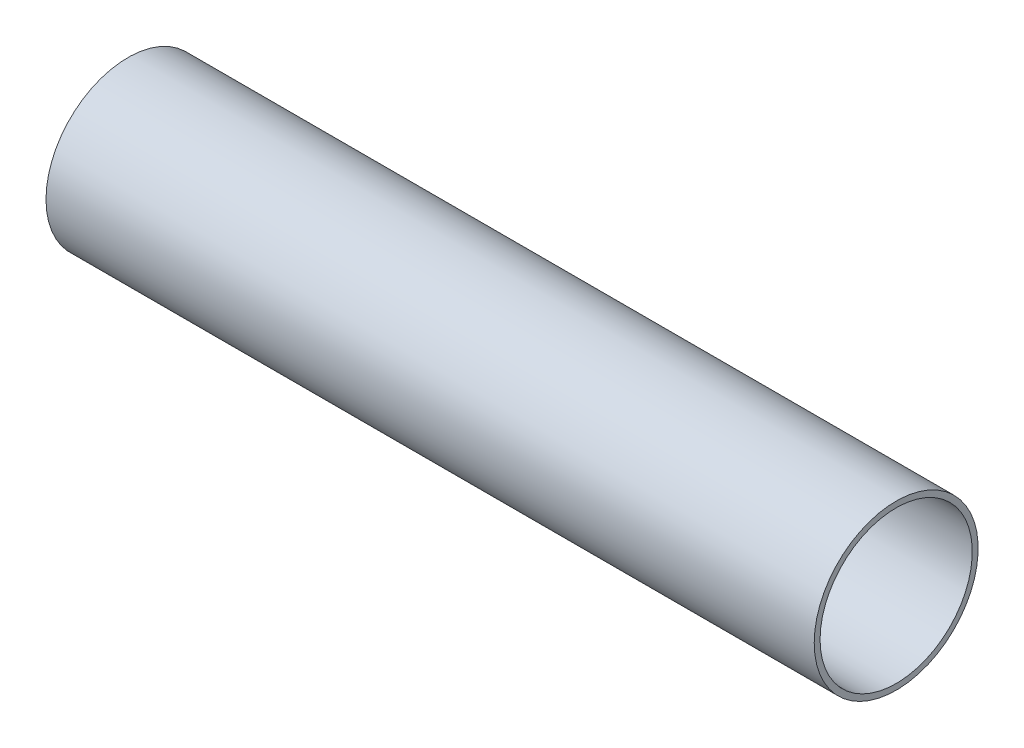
ISO-10303-21;
HEADER;
FILE_DESCRIPTION(('STEP AP214'),'2;1');
FILE_NAME('part.step','',(''),(''),'','','');
FILE_SCHEMA(('AUTOMOTIVE_DESIGN { 1 0 10303 214 1 1 1 1 }'));
ENDSEC;
DATA;
#1=APPLICATION_CONTEXT('core data for automotive mechanical design processes');
#2=APPLICATION_PROTOCOL_DEFINITION('international standard','automotive_design',2000,#1);
#3=PRODUCT_CONTEXT('',#1,'mechanical');
#4=PRODUCT('Part','Part','',(#3));
#5=PRODUCT_RELATED_PRODUCT_CATEGORY('part','',(#4));
#6=PRODUCT_DEFINITION_FORMATION('','',#4);
#7=PRODUCT_DEFINITION_CONTEXT('part definition',#1,'design');
#8=PRODUCT_DEFINITION('design','',#6,#7);
#9=PRODUCT_DEFINITION_SHAPE('','',#8);
#10=(LENGTH_UNIT() NAMED_UNIT(*) SI_UNIT(.MILLI.,.METRE.));
#11=(NAMED_UNIT(*) PLANE_ANGLE_UNIT() SI_UNIT($,.RADIAN.));
#12=(NAMED_UNIT(*) SI_UNIT($,.STERADIAN.) SOLID_ANGLE_UNIT());
#13=UNCERTAINTY_MEASURE_WITH_UNIT(LENGTH_MEASURE(1.E-05),#10,'distance_accuracy_value','');
#14=(GEOMETRIC_REPRESENTATION_CONTEXT(3) GLOBAL_UNCERTAINTY_ASSIGNED_CONTEXT((#13)) GLOBAL_UNIT_ASSIGNED_CONTEXT((#10,
#11,#12)) REPRESENTATION_CONTEXT('',''));
#15=CARTESIAN_POINT('',(0.,0.,0.));
#16=DIRECTION('',(0.,0.,1.));
#17=DIRECTION('',(1.,0.,0.));
#18=AXIS2_PLACEMENT_3D('',#15,#16,#17);
#19=CARTESIAN_POINT('',(0.,0.,0.));
#20=DIRECTION('',(-0.999999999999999,0.,0.));
#21=DIRECTION('',(0.,0.,1.00000000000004));
#22=AXIS2_PLACEMENT_3D('',#19,#20,#21);
#23=CYLINDRICAL_SURFACE('',#22,13.);
#24=CARTESIAN_POINT('',(131.2,0.,0.));
#25=DIRECTION('',(-0.999999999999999,0.,0.));
#26=DIRECTION('',(0.,0.,1.00000000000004));
#27=AXIS2_PLACEMENT_3D('',#24,#25,#26);
#28=CIRCLE('',#27,13.);
#29=CARTESIAN_POINT('',(131.2,-1.14817248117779E-12,12.9999999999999));
#30=VERTEX_POINT('',#29);
#31=EDGE_CURVE('E52',#30,#30,#28,.T.);
#32=CARTESIAN_POINT('',(0.,0.,0.));
#33=DIRECTION('',(-0.999999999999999,0.,0.));
#34=DIRECTION('',(0.,0.,1.00000000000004));
#35=AXIS2_PLACEMENT_3D('',#32,#33,#34);
#36=CIRCLE('',#35,13.);
#37=CARTESIAN_POINT('',(0.,-1.69586567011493E-13,13.0000000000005));
#38=VERTEX_POINT('',#37);
#39=EDGE_CURVE('E12',#38,#38,#36,.T.);
#40=CARTESIAN_POINT('',(131.2,-1.14817248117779E-12,12.9999999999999));
#41=CARTESIAN_POINT('',(129.833333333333,-1.13797887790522E-12,12.9999999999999));
#42=CARTESIAN_POINT('',(128.466666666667,-1.12778527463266E-12,12.9999999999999));
#43=CARTESIAN_POINT('',(125.733333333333,-1.10739806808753E-12,12.9999999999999));
#44=CARTESIAN_POINT('',(124.366666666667,-1.09720446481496E-12,12.9999999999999));
#45=CARTESIAN_POINT('',(121.633333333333,-1.07681725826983E-12,12.9999999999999));
#46=CARTESIAN_POINT('',(120.266666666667,-1.06662365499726E-12,13.));
#47=CARTESIAN_POINT('',(117.533333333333,-1.04623644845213E-12,13.));
#48=CARTESIAN_POINT('',(116.166666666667,-1.03604284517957E-12,13.));
#49=CARTESIAN_POINT('',(113.433333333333,-1.01565563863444E-12,13.));
#50=CARTESIAN_POINT('',(112.066666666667,-1.00546203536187E-12,13.));
#51=CARTESIAN_POINT('',(109.333333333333,-9.85074828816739E-13,13.));
#52=CARTESIAN_POINT('',(107.966666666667,-9.74881225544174E-13,13.));
#53=CARTESIAN_POINT('',(105.233333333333,-9.54494018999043E-13,13.));
#54=CARTESIAN_POINT('',(103.866666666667,-9.44300415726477E-13,13.));
#55=CARTESIAN_POINT('',(101.133333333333,-9.23913209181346E-13,13.));
#56=CARTESIAN_POINT('',(99.7666666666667,-9.1371960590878E-13,13.));
#57=CARTESIAN_POINT('',(97.0333333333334,-8.93332399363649E-13,13.0000000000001));
#58=CARTESIAN_POINT('',(95.6666666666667,-8.83138796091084E-13,13.0000000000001));
#59=CARTESIAN_POINT('',(92.9333333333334,-8.62751589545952E-13,13.0000000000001));
#60=CARTESIAN_POINT('',(91.5666666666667,-8.52557986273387E-13,13.0000000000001));
#61=CARTESIAN_POINT('',(88.8333333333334,-8.32170779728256E-13,13.0000000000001));
#62=CARTESIAN_POINT('',(87.4666666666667,-8.2197717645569E-13,13.0000000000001));
#63=CARTESIAN_POINT('',(84.7333333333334,-8.01589969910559E-13,13.0000000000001));
#64=CARTESIAN_POINT('',(83.3666666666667,-7.91396366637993E-13,13.0000000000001));
#65=CARTESIAN_POINT('',(80.6333333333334,-7.71009160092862E-13,13.0000000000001));
#66=CARTESIAN_POINT('',(79.2666666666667,-7.60815556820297E-13,13.0000000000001));
#67=CARTESIAN_POINT('',(76.5333333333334,-7.40428350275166E-13,13.0000000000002));
#68=CARTESIAN_POINT('',(75.1666666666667,-7.302347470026E-13,13.0000000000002));
#69=CARTESIAN_POINT('',(72.4333333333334,-7.09847540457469E-13,13.0000000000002));
#70=CARTESIAN_POINT('',(71.0666666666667,-6.99653937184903E-13,13.0000000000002));
#71=CARTESIAN_POINT('',(68.3333333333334,-6.79266730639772E-13,13.0000000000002));
#72=CARTESIAN_POINT('',(66.9666666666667,-6.69073127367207E-13,13.0000000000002));
#73=CARTESIAN_POINT('',(64.2333333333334,-6.48685920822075E-13,13.0000000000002));
#74=CARTESIAN_POINT('',(62.8666666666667,-6.3849231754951E-13,13.0000000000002));
#75=CARTESIAN_POINT('',(60.1333333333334,-6.18105111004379E-13,13.0000000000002));
#76=CARTESIAN_POINT('',(58.7666666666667,-6.07911507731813E-13,13.0000000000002));
#77=CARTESIAN_POINT('',(56.0333333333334,-5.87524301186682E-13,13.0000000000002));
#78=CARTESIAN_POINT('',(54.6666666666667,-5.77330697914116E-13,13.0000000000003));
#79=CARTESIAN_POINT('',(51.9333333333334,-5.56943491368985E-13,13.0000000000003));
#80=CARTESIAN_POINT('',(50.5666666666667,-5.4674988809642E-13,13.0000000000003));
#81=CARTESIAN_POINT('',(47.8333333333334,-5.26362681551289E-13,13.0000000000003));
#82=CARTESIAN_POINT('',(46.4666666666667,-5.16169078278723E-13,13.0000000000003));
#83=CARTESIAN_POINT('',(43.7333333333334,-4.95781871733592E-13,13.0000000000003));
#84=CARTESIAN_POINT('',(42.3666666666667,-4.85588268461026E-13,13.0000000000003));
#85=CARTESIAN_POINT('',(39.6333333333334,-4.65201061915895E-13,13.0000000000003));
#86=CARTESIAN_POINT('',(38.2666666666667,-4.5500745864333E-13,13.0000000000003));
#87=CARTESIAN_POINT('',(35.5333333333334,-4.34620252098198E-13,13.0000000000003));
#88=CARTESIAN_POINT('',(34.1666666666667,-4.24426648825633E-13,13.0000000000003));
#89=CARTESIAN_POINT('',(31.4333333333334,-4.04039442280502E-13,13.0000000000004));
#90=CARTESIAN_POINT('',(30.0666666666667,-3.93845839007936E-13,13.0000000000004));
#91=CARTESIAN_POINT('',(27.3333333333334,-3.73458632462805E-13,13.0000000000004));
#92=CARTESIAN_POINT('',(25.9666666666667,-3.63265029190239E-13,13.0000000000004));
#93=CARTESIAN_POINT('',(23.2333333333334,-3.42877822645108E-13,13.0000000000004));
#94=CARTESIAN_POINT('',(21.8666666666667,-3.32684219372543E-13,13.0000000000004));
#95=CARTESIAN_POINT('',(19.1333333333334,-3.12297012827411E-13,13.0000000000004));
#96=CARTESIAN_POINT('',(17.7666666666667,-3.02103409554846E-13,13.0000000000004));
#97=CARTESIAN_POINT('',(15.0333333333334,-2.81716203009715E-13,13.0000000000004));
#98=CARTESIAN_POINT('',(13.6666666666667,-2.71522599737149E-13,13.0000000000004));
#99=CARTESIAN_POINT('',(10.9333333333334,-2.51135393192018E-13,13.0000000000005));
#100=CARTESIAN_POINT('',(9.56666666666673,-2.40941789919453E-13,13.0000000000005));
#101=CARTESIAN_POINT('',(6.8333333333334,-2.20554583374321E-13,13.0000000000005));
#102=CARTESIAN_POINT('',(5.46666666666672,-2.10360980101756E-13,13.0000000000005));
#103=CARTESIAN_POINT('',(2.73333333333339,-1.89973773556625E-13,13.0000000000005));
#104=CARTESIAN_POINT('',(1.36666666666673,-1.79780170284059E-13,13.0000000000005));
#105=CARTESIAN_POINT('',(0.,-1.69586567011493E-13,13.0000000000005));
#106=B_SPLINE_CURVE_WITH_KNOTS('',3,(#40,#41,#42,#43,#44,#45,#46,#47,#48,#49,#50,#51,#52,#53,
#54,#55,#56,#57,#58,#59,#60,#61,#62,#63,#64,#65,#66,#67,#68,#69,#70,#71,#72,#73,#74,#75,#76,#77,
#78,#79,#80,#81,#82,#83,#84,#85,#86,#87,#88,#89,#90,#91,#92,#93,#94,#95,#96,#97,#98,#99,#100,
#101,#102,#103,#104,#105),.UNSPECIFIED.,.F.,.F.,(4,2,2,2,2,2,2,2,2,2,2,2,2,2,2,2,2,2,2,2,2,2,2,
2,2,2,2,2,2,2,2,2,4),(0.,4.09999999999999,8.20000000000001,12.3,16.4,20.5,24.6,28.7,32.8,36.9,
41.,45.1,49.2,53.3,57.4,61.5,65.6,69.7,73.8,77.9,82.,86.1,90.1999999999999,94.3,98.4,102.5,
106.6,110.7,114.8,118.9,123.,127.1,131.2),.UNSPECIFIED.);
#107=EDGE_CURVE('BSEAM38',#30,#38,#106,.T.);
#108=ORIENTED_EDGE('',*,*,#31,.F.);
#109=ORIENTED_EDGE('',*,*,#39,.T.);
#110=ORIENTED_EDGE('',*,*,#107,.T.);
#111=ORIENTED_EDGE('',*,*,#107,.F.);
#112=EDGE_LOOP('',(#108,#110,#109,#111));
#113=FACE_BOUND('',#112,.T.);
#114=ADVANCED_FACE('F38',(#113),#23,.F.);
#115=CARTESIAN_POINT('',(0.,13.,0.));
#116=DIRECTION('',(0.999999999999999,0.,0.));
#117=DIRECTION('',(0.,0.,-1.00000000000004));
#118=AXIS2_PLACEMENT_3D('',#115,#116,#117);
#119=PLANE('',#118);
#120=ORIENTED_EDGE('',*,*,#39,.F.);
#121=EDGE_LOOP('',(#120));
#122=FACE_BOUND('',#121,.T.);
#123=CARTESIAN_POINT('',(0.,0.,0.));
#124=DIRECTION('',(-0.999999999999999,0.,0.));
#125=DIRECTION('',(0.,0.,1.00000000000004));
#126=AXIS2_PLACEMENT_3D('',#123,#124,#125);
#127=CIRCLE('',#126,14.);
#128=CARTESIAN_POINT('',(0.,-1.82631687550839E-13,14.0000000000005));
#129=VERTEX_POINT('',#128);
#130=EDGE_CURVE('E44',#129,#129,#127,.T.);
#131=ORIENTED_EDGE('',*,*,#130,.T.);
#132=EDGE_LOOP('',(#131));
#133=FACE_BOUND('',#132,.T.);
#134=ADVANCED_FACE('F61',(#122,#133),#119,.F.);
#135=CARTESIAN_POINT('',(0.,0.,0.));
#136=DIRECTION('',(-0.999999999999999,0.,0.));
#137=DIRECTION('',(0.,0.,1.00000000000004));
#138=AXIS2_PLACEMENT_3D('',#135,#136,#137);
#139=CYLINDRICAL_SURFACE('',#138,14.);
#140=CARTESIAN_POINT('',(131.2,0.,0.));
#141=DIRECTION('',(-0.999999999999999,0.,0.));
#142=DIRECTION('',(0.,0.,1.00000000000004));
#143=AXIS2_PLACEMENT_3D('',#140,#141,#142);
#144=CIRCLE('',#143,14.);
#145=CARTESIAN_POINT('',(131.2,-1.16121760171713E-12,13.9999999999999));
#146=VERTEX_POINT('',#145);
#147=EDGE_CURVE('E48',#146,#146,#144,.T.);
#148=CARTESIAN_POINT('',(0.,-1.82631687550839E-13,14.0000000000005));
#149=CARTESIAN_POINT('',(1.36666666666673,-1.92825290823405E-13,14.0000000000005));
#150=CARTESIAN_POINT('',(2.7333333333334,-2.0301889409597E-13,14.0000000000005));
#151=CARTESIAN_POINT('',(5.46666666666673,-2.23406100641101E-13,14.0000000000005));
#152=CARTESIAN_POINT('',(6.8333333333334,-2.33599703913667E-13,14.0000000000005));
#153=CARTESIAN_POINT('',(9.56666666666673,-2.53986910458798E-13,14.0000000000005));
#154=CARTESIAN_POINT('',(10.9333333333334,-2.64180513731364E-13,14.0000000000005));
#155=CARTESIAN_POINT('',(13.6666666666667,-2.84567720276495E-13,14.0000000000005));
#156=CARTESIAN_POINT('',(15.0333333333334,-2.9476132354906E-13,14.0000000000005));
#157=CARTESIAN_POINT('',(17.7666666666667,-3.15148530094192E-13,14.0000000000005));
#158=CARTESIAN_POINT('',(19.1333333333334,-3.25342133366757E-13,14.0000000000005));
#159=CARTESIAN_POINT('',(21.8666666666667,-3.45729339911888E-13,14.0000000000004));
#160=CARTESIAN_POINT('',(23.2333333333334,-3.55922943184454E-13,14.0000000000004));
#161=CARTESIAN_POINT('',(25.9666666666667,-3.76310149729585E-13,14.0000000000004));
#162=CARTESIAN_POINT('',(27.3333333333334,-3.86503753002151E-13,14.0000000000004));
#163=CARTESIAN_POINT('',(30.0666666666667,-4.06890959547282E-13,14.0000000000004));
#164=CARTESIAN_POINT('',(31.4333333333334,-4.17084562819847E-13,14.0000000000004));
#165=CARTESIAN_POINT('',(34.1666666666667,-4.37471769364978E-13,14.0000000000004));
#166=CARTESIAN_POINT('',(35.5333333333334,-4.47665372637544E-13,14.0000000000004));
#167=CARTESIAN_POINT('',(38.2666666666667,-4.68052579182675E-13,14.0000000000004));
#168=CARTESIAN_POINT('',(39.6333333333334,-4.78246182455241E-13,14.0000000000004));
#169=CARTESIAN_POINT('',(42.3666666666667,-4.98633389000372E-13,14.0000000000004));
#170=CARTESIAN_POINT('',(43.7333333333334,-5.08826992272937E-13,14.0000000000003));
#171=CARTESIAN_POINT('',(46.4666666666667,-5.29214198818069E-13,14.0000000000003));
#172=CARTESIAN_POINT('',(47.8333333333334,-5.39407802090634E-13,14.0000000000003));
#173=CARTESIAN_POINT('',(50.5666666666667,-5.59795008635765E-13,14.0000000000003));
#174=CARTESIAN_POINT('',(51.9333333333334,-5.69988611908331E-13,14.0000000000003));
#175=CARTESIAN_POINT('',(54.6666666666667,-5.90375818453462E-13,14.0000000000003));
#176=CARTESIAN_POINT('',(56.0333333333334,-6.00569421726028E-13,14.0000000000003));
#177=CARTESIAN_POINT('',(58.7666666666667,-6.20956628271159E-13,14.0000000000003));
#178=CARTESIAN_POINT('',(60.1333333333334,-6.31150231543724E-13,14.0000000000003));
#179=CARTESIAN_POINT('',(62.8666666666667,-6.51537438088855E-13,14.0000000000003));
#180=CARTESIAN_POINT('',(64.2333333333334,-6.61731041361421E-13,14.0000000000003));
#181=CARTESIAN_POINT('',(66.9666666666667,-6.82118247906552E-13,14.0000000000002));
#182=CARTESIAN_POINT('',(68.3333333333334,-6.92311851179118E-13,14.0000000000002));
#183=CARTESIAN_POINT('',(71.0666666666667,-7.12699057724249E-13,14.0000000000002));
#184=CARTESIAN_POINT('',(72.4333333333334,-7.22892660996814E-13,14.0000000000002));
#185=CARTESIAN_POINT('',(75.1666666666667,-7.43279867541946E-13,14.0000000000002));
#186=CARTESIAN_POINT('',(76.5333333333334,-7.53473470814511E-13,14.0000000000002));
#187=CARTESIAN_POINT('',(79.2666666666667,-7.73860677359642E-13,14.0000000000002));
#188=CARTESIAN_POINT('',(80.6333333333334,-7.84054280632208E-13,14.0000000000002));
#189=CARTESIAN_POINT('',(83.3666666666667,-8.04441487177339E-13,14.0000000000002));
#190=CARTESIAN_POINT('',(84.7333333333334,-8.14635090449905E-13,14.0000000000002));
#191=CARTESIAN_POINT('',(87.4666666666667,-8.35022296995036E-13,14.0000000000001));
#192=CARTESIAN_POINT('',(88.8333333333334,-8.45215900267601E-13,14.0000000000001));
#193=CARTESIAN_POINT('',(91.5666666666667,-8.65603106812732E-13,14.0000000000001));
#194=CARTESIAN_POINT('',(92.9333333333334,-8.75796710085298E-13,14.0000000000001));
#195=CARTESIAN_POINT('',(95.6666666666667,-8.96183916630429E-13,14.0000000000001));
#196=CARTESIAN_POINT('',(97.0333333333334,-9.06377519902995E-13,14.0000000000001));
#197=CARTESIAN_POINT('',(99.7666666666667,-9.26764726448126E-13,14.0000000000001));
#198=CARTESIAN_POINT('',(101.133333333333,-9.36958329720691E-13,14.0000000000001));
#199=CARTESIAN_POINT('',(103.866666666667,-9.57345536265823E-13,14.0000000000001));
#200=CARTESIAN_POINT('',(105.233333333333,-9.67539139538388E-13,14.0000000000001));
#201=CARTESIAN_POINT('',(107.966666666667,-9.87926346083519E-13,14.));
#202=CARTESIAN_POINT('',(109.333333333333,-9.98119949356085E-13,14.));
#203=CARTESIAN_POINT('',(112.066666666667,-1.01850715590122E-12,14.));
#204=CARTESIAN_POINT('',(113.433333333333,-1.02870075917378E-12,14.));
#205=CARTESIAN_POINT('',(116.166666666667,-1.04908796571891E-12,14.));
#206=CARTESIAN_POINT('',(117.533333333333,-1.05928156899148E-12,14.));
#207=CARTESIAN_POINT('',(120.266666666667,-1.07966877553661E-12,14.));
#208=CARTESIAN_POINT('',(121.633333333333,-1.08986237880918E-12,14.));
#209=CARTESIAN_POINT('',(124.366666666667,-1.11024958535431E-12,14.));
#210=CARTESIAN_POINT('',(125.733333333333,-1.12044318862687E-12,14.));
#211=CARTESIAN_POINT('',(128.466666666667,-1.140830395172E-12,14.));
#212=CARTESIAN_POINT('',(129.833333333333,-1.15102399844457E-12,13.9999999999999));
#213=CARTESIAN_POINT('',(131.2,-1.16121760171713E-12,13.9999999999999));
#214=B_SPLINE_CURVE_WITH_KNOTS('',3,(#148,#149,#150,#151,#152,#153,#154,#155,#156,#157,#158,
#159,#160,#161,#162,#163,#164,#165,#166,#167,#168,#169,#170,#171,#172,#173,#174,#175,#176,#177,
#178,#179,#180,#181,#182,#183,#184,#185,#186,#187,#188,#189,#190,#191,#192,#193,#194,#195,#196,
#197,#198,#199,#200,#201,#202,#203,#204,#205,#206,#207,#208,#209,#210,#211,#212,#213),
.UNSPECIFIED.,.F.,.F.,(4,2,2,2,2,2,2,2,2,2,2,2,2,2,2,2,2,2,2,2,2,2,2,2,2,2,2,2,2,2,2,2,4),(0.,
4.1,8.2,12.3,16.4,20.5,24.6,28.7,32.8,36.9,41.,45.1,49.2,53.3,57.4,61.5,65.6,69.7,73.8,77.9,82.,
86.1,90.2,94.3,98.4,102.5,106.6,110.7,114.8,118.9,123.,127.1,131.2),.UNSPECIFIED.);
#215=EDGE_CURVE('BSEAM65',#129,#146,#214,.T.);
#216=ORIENTED_EDGE('',*,*,#130,.F.);
#217=ORIENTED_EDGE('',*,*,#147,.T.);
#218=ORIENTED_EDGE('',*,*,#215,.T.);
#219=ORIENTED_EDGE('',*,*,#215,.F.);
#220=EDGE_LOOP('',(#216,#218,#217,#219));
#221=FACE_BOUND('',#220,.T.);
#222=ADVANCED_FACE('F65',(#221),#139,.T.);
#223=CARTESIAN_POINT('',(131.200000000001,14.0000000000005,0.));
#224=DIRECTION('',(-0.999999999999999,0.,0.));
#225=DIRECTION('',(0.,0.,1.00000000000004));
#226=AXIS2_PLACEMENT_3D('',#223,#224,#225);
#227=PLANE('',#226);
#228=ORIENTED_EDGE('',*,*,#147,.F.);
#229=EDGE_LOOP('',(#228));
#230=FACE_BOUND('',#229,.T.);
#231=ORIENTED_EDGE('',*,*,#31,.T.);
#232=EDGE_LOOP('',(#231));
#233=FACE_BOUND('',#232,.T.);
#234=ADVANCED_FACE('F58',(#230,#233),#227,.F.);
#235=CLOSED_SHELL('',(#114,#134,#222,#234));
#236=MANIFOLD_SOLID_BREP('B2',#235);
#237=ADVANCED_BREP_SHAPE_REPRESENTATION('',(#18,#236),#14);
#238=SHAPE_DEFINITION_REPRESENTATION(#9,#237);
ENDSEC;
END-ISO-10303-21;
